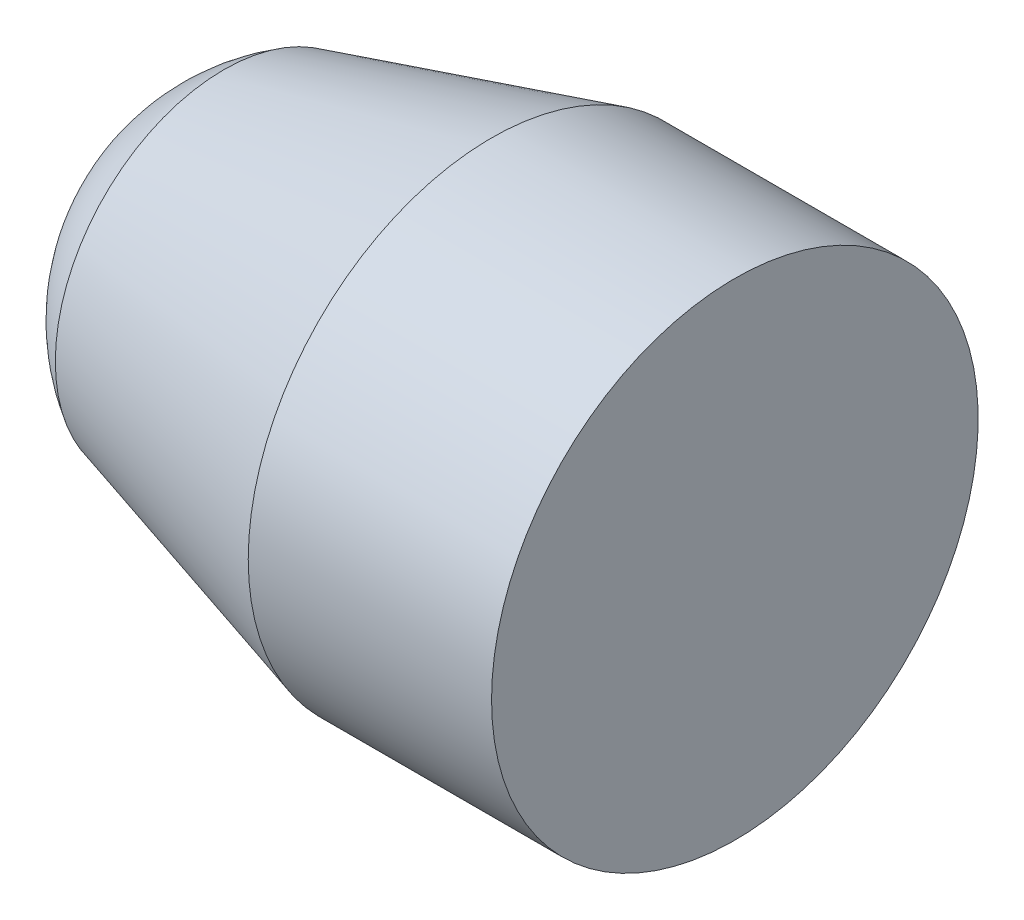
ISO-10303-21;
HEADER;
FILE_DESCRIPTION(('STEP AP214'),'2;1');
FILE_NAME('part.step','',(''),(''),'','','');
FILE_SCHEMA(('AUTOMOTIVE_DESIGN { 1 0 10303 214 1 1 1 1 }'));
ENDSEC;
DATA;
#1=APPLICATION_CONTEXT('core data for automotive mechanical design processes');
#2=APPLICATION_PROTOCOL_DEFINITION('international standard','automotive_design',2000,#1);
#3=PRODUCT_CONTEXT('',#1,'mechanical');
#4=PRODUCT('Part','Part','',(#3));
#5=PRODUCT_RELATED_PRODUCT_CATEGORY('part','',(#4));
#6=PRODUCT_DEFINITION_FORMATION('','',#4);
#7=PRODUCT_DEFINITION_CONTEXT('part definition',#1,'design');
#8=PRODUCT_DEFINITION('design','',#6,#7);
#9=PRODUCT_DEFINITION_SHAPE('','',#8);
#10=(LENGTH_UNIT() NAMED_UNIT(*) SI_UNIT(.MILLI.,.METRE.));
#11=(NAMED_UNIT(*) PLANE_ANGLE_UNIT() SI_UNIT($,.RADIAN.));
#12=(NAMED_UNIT(*) SI_UNIT($,.STERADIAN.) SOLID_ANGLE_UNIT());
#13=UNCERTAINTY_MEASURE_WITH_UNIT(LENGTH_MEASURE(1.E-05),#10,'distance_accuracy_value','');
#14=(GEOMETRIC_REPRESENTATION_CONTEXT(3) GLOBAL_UNCERTAINTY_ASSIGNED_CONTEXT((#13)) GLOBAL_UNIT_ASSIGNED_CONTEXT((#10,
#11,#12)) REPRESENTATION_CONTEXT('',''));
#15=CARTESIAN_POINT('',(0.,0.,0.));
#16=DIRECTION('',(0.,0.,1.));
#17=DIRECTION('',(1.,0.,0.));
#18=AXIS2_PLACEMENT_3D('',#15,#16,#17);
#19=CARTESIAN_POINT('',(-0.342165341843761,0.,0.));
#20=DIRECTION('',(-1.,0.,0.));
#21=DIRECTION('',(0.,0.,1.));
#22=AXIS2_PLACEMENT_3D('',#19,#20,#21);
#23=CYLINDRICAL_SURFACE('',#22,2.54);
#24=CARTESIAN_POINT('',(3.81,0.,0.));
#25=DIRECTION('',(-1.,0.,0.));
#26=DIRECTION('',(0.,0.,1.));
#27=AXIS2_PLACEMENT_3D('',#24,#25,#26);
#28=CIRCLE('',#27,2.54);
#29=CARTESIAN_POINT('',(3.81,0.,2.54));
#30=VERTEX_POINT('',#29);
#31=EDGE_CURVE('E10',#30,#30,#28,.T.);
#32=ORIENTED_EDGE('',*,*,#31,.F.);
#33=EDGE_LOOP('',(#32));
#34=FACE_BOUND('',#33,.T.);
#35=CARTESIAN_POINT('',(6.35,0.,0.));
#36=DIRECTION('',(-1.,0.,0.));
#37=DIRECTION('',(0.,0.,1.));
#38=AXIS2_PLACEMENT_3D('',#35,#36,#37);
#39=CIRCLE('',#38,2.54);
#40=CARTESIAN_POINT('',(6.35,0.,2.54));
#41=VERTEX_POINT('',#40);
#42=EDGE_CURVE('E38',#41,#41,#39,.T.);
#43=ORIENTED_EDGE('',*,*,#42,.T.);
#44=EDGE_LOOP('',(#43));
#45=FACE_BOUND('',#44,.T.);
#46=ADVANCED_FACE('F28',(#34,#45),#23,.T.);
#47=CARTESIAN_POINT('',(3.81,0.,0.));
#48=DIRECTION('',(1.,0.,0.));
#49=DIRECTION('',(0.,0.,-1.));
#50=AXIS2_PLACEMENT_3D('',#47,#48,#49);
#51=CONICAL_SURFACE('',#50,2.54,0.272317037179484);
#52=CARTESIAN_POINT('',(1.016,0.,0.));
#53=DIRECTION('',(-1.,0.,0.));
#54=DIRECTION('',(0.,0.,1.));
#55=AXIS2_PLACEMENT_3D('',#52,#53,#54);
#56=CIRCLE('',#55,1.75976362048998);
#57=CARTESIAN_POINT('',(1.016,0.,1.75976362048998));
#58=VERTEX_POINT('',#57);
#59=EDGE_CURVE('E34',#58,#58,#56,.T.);
#60=ORIENTED_EDGE('',*,*,#59,.F.);
#61=EDGE_LOOP('',(#60));
#62=FACE_BOUND('',#61,.T.);
#63=ORIENTED_EDGE('',*,*,#31,.T.);
#64=EDGE_LOOP('',(#63));
#65=FACE_BOUND('',#64,.T.);
#66=ADVANCED_FACE('F53',(#62,#65),#51,.T.);
#67=CARTESIAN_POINT('',(2.032,0.,0.));
#68=DIRECTION('',(-1.,0.,0.));
#69=DIRECTION('',(0.,1.,0.));
#70=AXIS2_PLACEMENT_3D('',#67,#68,#69);
#71=SPHERICAL_SURFACE('',#70,2.032);
#72=ORIENTED_EDGE('',*,*,#59,.T.);
#73=EDGE_LOOP('',(#72));
#74=FACE_BOUND('',#73,.T.);
#75=ADVANCED_FACE('F48',(#74),#71,.T.);
#76=CARTESIAN_POINT('',(6.35,2.54,0.));
#77=DIRECTION('',(-1.,0.,0.));
#78=DIRECTION('',(0.,0.,1.));
#79=AXIS2_PLACEMENT_3D('',#76,#77,#78);
#80=PLANE('',#79);
#81=ORIENTED_EDGE('',*,*,#42,.F.);
#82=EDGE_LOOP('',(#81));
#83=FACE_BOUND('',#82,.T.);
#84=ADVANCED_FACE('F46',(#83),#80,.F.);
#85=CLOSED_SHELL('',(#46,#66,#75,#84));
#86=MANIFOLD_SOLID_BREP('B2',#85);
#87=ADVANCED_BREP_SHAPE_REPRESENTATION('',(#18,#86),#14);
#88=SHAPE_DEFINITION_REPRESENTATION(#9,#87);
ENDSEC;
END-ISO-10303-21;
